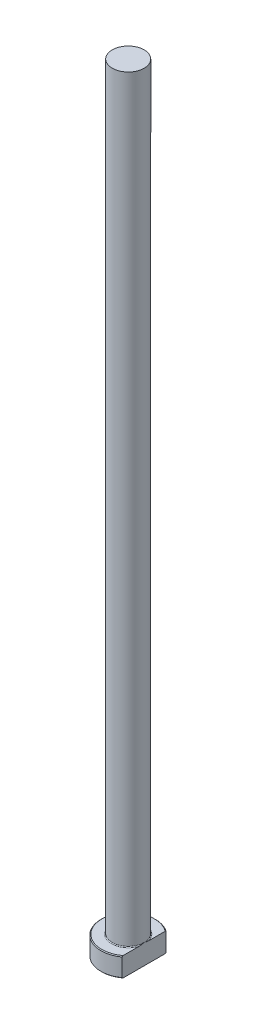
from build123d import *
from build123d.topology import SkipClean

# Parameters (mm, degrees)
CHAMFER1_SIZE = 0.2
FILLET1_R     = 0.2
KEY_DEPTH     = 201.244850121


with BuildPart() as part:
    # Sketch1 → Revolve1 (revolve)
    with BuildSketch(Plane.XY, mode=Mode.PRIVATE) as revolve1_sk:
        Polygon((0, 0), (-7, 0), (-7, 5), (-4.1, 5), (-4.1, 200), (0, 200), align=None)
    revolve(revolve1_sk.sketch.rotate(Axis((0, 259.958771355, 0), (0, -1, 0)), 270), axis=Axis((0, 259.958771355, 0), (0, -1, 0)))

    # Chamfer1
    chamfer1_edges = [part.edges().sort_by_distance(p)[0] for p in [
        (0, 5, -7),
        (0, 0, -7),
    ]]
    chamfer(chamfer1_edges, length=CHAMFER1_SIZE)

    # Fillet1
    fillet1_edges = [part.edges().sort_by_distance(p)[0] for p in [
        (0, 5, -4.1),
    ]]
    fillet(fillet1_edges, radius=FILLET1_R)

    # Sketch2 → KEY (cut, through all)
    with SkipClean():  # the faces are left unmerged after this step: merging them gives an invalid solid
        with BuildSketch(Plane(origin=(0, 0, 0), x_dir=(1, 0, 0), z_dir=(0, 1, 0))):
            with BuildLine():
                Line((4.1, 5.673623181), (4.1, -5.673623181))
                ThreePointArc((4.1, -5.673623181), (7, 0), (4.1, 5.673623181))
            make_face()
        extrude(amount=KEY_DEPTH, mode=Mode.SUBTRACT)


solid = part.part
